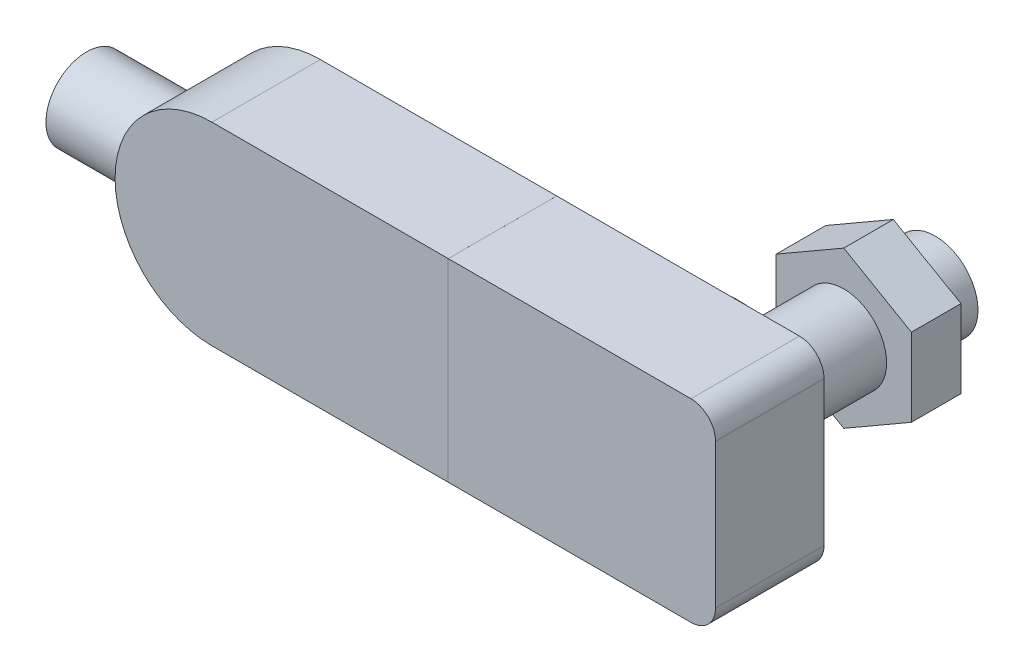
ISO-10303-21;
HEADER;
FILE_DESCRIPTION(('STEP AP214'),'2;1');
FILE_NAME('part.step','',(''),(''),'','','');
FILE_SCHEMA(('AUTOMOTIVE_DESIGN { 1 0 10303 214 1 1 1 1 }'));
ENDSEC;
DATA;
#1=APPLICATION_CONTEXT('core data for automotive mechanical design processes');
#2=APPLICATION_PROTOCOL_DEFINITION('international standard','automotive_design',2000,#1);
#3=PRODUCT_CONTEXT('',#1,'mechanical');
#4=PRODUCT('Part','Part','',(#3));
#5=PRODUCT_RELATED_PRODUCT_CATEGORY('part','',(#4));
#6=PRODUCT_DEFINITION_FORMATION('','',#4);
#7=PRODUCT_DEFINITION_CONTEXT('part definition',#1,'design');
#8=PRODUCT_DEFINITION('design','',#6,#7);
#9=PRODUCT_DEFINITION_SHAPE('','',#8);
#10=(LENGTH_UNIT() NAMED_UNIT(*) SI_UNIT(.MILLI.,.METRE.));
#11=(NAMED_UNIT(*) PLANE_ANGLE_UNIT() SI_UNIT($,.RADIAN.));
#12=(NAMED_UNIT(*) SI_UNIT($,.STERADIAN.) SOLID_ANGLE_UNIT());
#13=UNCERTAINTY_MEASURE_WITH_UNIT(LENGTH_MEASURE(1.E-05),#10,'distance_accuracy_value','');
#14=(GEOMETRIC_REPRESENTATION_CONTEXT(3) GLOBAL_UNCERTAINTY_ASSIGNED_CONTEXT((#13)) GLOBAL_UNIT_ASSIGNED_CONTEXT((#10,
#11,#12)) REPRESENTATION_CONTEXT('',''));
#15=CARTESIAN_POINT('',(0.,0.,0.));
#16=DIRECTION('',(0.,0.,1.));
#17=DIRECTION('',(1.,0.,0.));
#18=AXIS2_PLACEMENT_3D('',#15,#16,#17);
#19=CARTESIAN_POINT('',(-21.928,-12.5,65.2633204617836));
#20=DIRECTION('',(1.,0.,0.));
#21=DIRECTION('',(0.,0.,-1.));
#22=AXIS2_PLACEMENT_3D('',#19,#20,#21);
#23=PLANE('',#22);
#24=DIRECTION('',(0.,1.,0.));
#25=VECTOR('',#24,1.);
#26=CARTESIAN_POINT('',(-21.928,-12.5,15.524));
#27=LINE('',#26,#25);
#28=CARTESIAN_POINT('',(-21.928,-12.5,15.524));
#29=VERTEX_POINT('',#28);
#30=CARTESIAN_POINT('',(-21.928,12.5,15.524));
#31=VERTEX_POINT('',#30);
#32=EDGE_CURVE('E116',#29,#31,#27,.T.);
#33=ORIENTED_EDGE('',*,*,#32,.F.);
#34=DIRECTION('',(0.,0.,-1.));
#35=VECTOR('',#34,1.);
#36=CARTESIAN_POINT('',(-21.928,-12.5,65.2633204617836));
#37=LINE('',#36,#35);
#38=CARTESIAN_POINT('',(-21.928,-12.5,1.524));
#39=VERTEX_POINT('',#38);
#40=EDGE_CURVE('E110',#29,#39,#37,.T.);
#41=ORIENTED_EDGE('',*,*,#40,.T.);
#42=DIRECTION('',(0.,-1.,0.));
#43=VECTOR('',#42,1.);
#44=CARTESIAN_POINT('',(-21.928,-12.5,1.524));
#45=LINE('',#44,#43);
#46=CARTESIAN_POINT('',(-21.928,12.5,1.524));
#47=VERTEX_POINT('',#46);
#48=EDGE_CURVE('E114',#47,#39,#45,.T.);
#49=ORIENTED_EDGE('',*,*,#48,.F.);
#50=DIRECTION('',(0.,0.,-1.));
#51=VECTOR('',#50,1.);
#52=CARTESIAN_POINT('',(-21.928,12.5,65.2633204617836));
#53=LINE('',#52,#51);
#54=EDGE_CURVE('E141',#31,#47,#53,.T.);
#55=ORIENTED_EDGE('',*,*,#54,.F.);
#56=EDGE_LOOP('',(#33,#41,#49,#55));
#57=FACE_BOUND('',#56,.T.);
#58=ADVANCED_FACE('F71',(#57),#23,.T.);
#59=CARTESIAN_POINT('',(-21.928,12.5,65.2633204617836));
#60=DIRECTION('',(0.,1.,0.));
#61=DIRECTION('',(0.,0.,1.));
#62=AXIS2_PLACEMENT_3D('',#59,#60,#61);
#63=PLANE('',#62);
#64=DIRECTION('',(-1.,0.,0.));
#65=VECTOR('',#64,1.);
#66=CARTESIAN_POINT('',(-21.928,12.5,15.524));
#67=LINE('',#66,#65);
#68=CARTESIAN_POINT('',(-52.4280000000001,12.5,15.524));
#69=VERTEX_POINT('',#68);
#70=EDGE_CURVE('E146',#31,#69,#67,.T.);
#71=ORIENTED_EDGE('',*,*,#70,.F.);
#72=ORIENTED_EDGE('',*,*,#54,.T.);
#73=DIRECTION('',(1.,0.,0.));
#74=VECTOR('',#73,1.);
#75=CARTESIAN_POINT('',(-21.928,12.5,1.524));
#76=LINE('',#75,#74);
#77=CARTESIAN_POINT('',(-52.4280000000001,12.5,1.524));
#78=VERTEX_POINT('',#77);
#79=EDGE_CURVE('E119',#78,#47,#76,.T.);
#80=ORIENTED_EDGE('',*,*,#79,.F.);
#81=DIRECTION('',(0.,0.,-1.));
#82=VECTOR('',#81,1.);
#83=CARTESIAN_POINT('',(-52.4280000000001,12.5,65.2633204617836));
#84=LINE('',#83,#82);
#85=EDGE_CURVE('E144',#69,#78,#84,.T.);
#86=ORIENTED_EDGE('',*,*,#85,.F.);
#87=EDGE_LOOP('',(#71,#72,#80,#86));
#88=FACE_BOUND('',#87,.T.);
#89=ADVANCED_FACE('F155',(#88),#63,.T.);
#90=CARTESIAN_POINT('',(-52.4280000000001,0.,65.2633204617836));
#91=DIRECTION('',(0.,0.,-1.));
#92=DIRECTION('',(-1.,0.,0.));
#93=AXIS2_PLACEMENT_3D('',#90,#91,#92);
#94=CYLINDRICAL_SURFACE('',#93,12.5);
#95=CARTESIAN_POINT('',(-64.9280000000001,0.,13.75));
#96=CARTESIAN_POINT('',(-64.9279992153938,0.140572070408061,13.7499990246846));
#97=CARTESIAN_POINT('',(-64.925622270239,0.281190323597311,13.7443464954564));
#98=CARTESIAN_POINT('',(-64.9161737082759,0.561424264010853,13.7217894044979));
#99=CARTESIAN_POINT('',(-64.9090991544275,0.701039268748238,13.7048778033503));
#100=CARTESIAN_POINT('',(-64.890422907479,0.978456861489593,13.6599325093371));
#101=CARTESIAN_POINT('',(-64.878812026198,1.1162551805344,13.631876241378));
#102=CARTESIAN_POINT('',(-64.8513640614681,1.38881247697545,13.5649191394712));
#103=CARTESIAN_POINT('',(-64.8355252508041,1.52357018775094,13.526013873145));
#104=CARTESIAN_POINT('',(-64.8000960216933,1.78858468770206,13.4379025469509));
#105=CARTESIAN_POINT('',(-64.7805202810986,1.91885680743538,13.3887367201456));
#106=CARTESIAN_POINT('',(-64.7380659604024,2.17465512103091,13.2804493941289));
#107=CARTESIAN_POINT('',(-64.7151861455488,2.30017951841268,13.2213241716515));
#108=CARTESIAN_POINT('',(-64.6424318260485,2.66833358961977,13.0297747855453));
#109=CARTESIAN_POINT('',(-64.5883930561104,2.90289695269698,12.8830586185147));
#110=CARTESIAN_POINT('',(-64.4716191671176,3.35537124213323,12.5480894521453));
#111=CARTESIAN_POINT('',(-64.4085966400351,3.57200197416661,12.3582231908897));
#112=CARTESIAN_POINT('',(-64.2821402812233,3.97155924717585,11.9455213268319));
#113=CARTESIAN_POINT('',(-64.218706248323,4.15446777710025,11.7226682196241));
#114=CARTESIAN_POINT('',(-64.1267902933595,4.40417335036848,11.3615893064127));
#115=CARTESIAN_POINT('',(-64.096000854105,4.4848946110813,11.2333585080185));
#116=CARTESIAN_POINT('',(-64.0371204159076,4.63517257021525,10.9699456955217));
#117=CARTESIAN_POINT('',(-64.0090283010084,4.70473389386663,10.8347665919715));
#118=CARTESIAN_POINT('',(-63.9564712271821,4.8320911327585,10.5582925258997));
#119=CARTESIAN_POINT('',(-63.9320064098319,4.88988658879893,10.4169973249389));
#120=CARTESIAN_POINT('',(-63.8875843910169,4.99310372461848,10.1293391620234));
#121=CARTESIAN_POINT('',(-63.8676248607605,5.03853179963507,9.98297886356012));
#122=CARTESIAN_POINT('',(-63.8337921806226,5.11464131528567,9.69342363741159));
#123=CARTESIAN_POINT('',(-63.8196717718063,5.14592866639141,9.55041686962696));
#124=CARTESIAN_POINT('',(-63.7967022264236,5.19647799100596,9.26193644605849));
#125=CARTESIAN_POINT('',(-63.7878506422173,5.21574554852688,9.11646396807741));
#126=CARTESIAN_POINT('',(-63.7757448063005,5.2420318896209,8.82422251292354));
#127=CARTESIAN_POINT('',(-63.7724890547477,5.24905395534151,8.67745389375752));
#128=CARTESIAN_POINT('',(-63.7716963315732,5.25076718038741,8.38383328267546));
#129=CARTESIAN_POINT('',(-63.7741590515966,5.24545900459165,8.23698129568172));
#130=CARTESIAN_POINT('',(-63.7842916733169,5.22348235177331,7.95592606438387));
#131=CARTESIAN_POINT('',(-63.7915380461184,5.20773747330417,7.82163406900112));
#132=CARTESIAN_POINT('',(-63.8105720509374,5.1660022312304,7.5549360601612));
#133=CARTESIAN_POINT('',(-63.8223611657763,5.14000852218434,7.42253067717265));
#134=CARTESIAN_POINT('',(-63.8501127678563,5.07804007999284,7.16055336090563));
#135=CARTESIAN_POINT('',(-63.8660743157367,5.04206759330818,7.03098079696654));
#136=CARTESIAN_POINT('',(-63.901693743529,4.9604763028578,6.77541377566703));
#137=CARTESIAN_POINT('',(-63.9213530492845,4.91485377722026,6.64942072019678));
#138=CARTESIAN_POINT('',(-63.9859608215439,4.76193374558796,6.27270789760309));
#139=CARTESIAN_POINT('',(-64.0359337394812,4.63986677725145,6.02865882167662));
#140=CARTESIAN_POINT('',(-64.1437201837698,4.36053141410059,5.56367693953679));
#141=CARTESIAN_POINT('',(-64.2015368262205,4.20324901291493,5.34275338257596));
#142=CARTESIAN_POINT('',(-64.3245519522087,3.84206901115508,4.91014395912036));
#143=CARTESIAN_POINT('',(-64.3899576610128,3.6353257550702,4.70088650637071));
#144=CARTESIAN_POINT('',(-64.5166169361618,3.18888566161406,4.31912987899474));
#145=CARTESIAN_POINT('',(-64.5778694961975,2.9491808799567,4.14663959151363));
#146=CARTESIAN_POINT('',(-64.6624509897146,2.56631395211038,3.91748406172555));
#147=CARTESIAN_POINT('',(-64.6897107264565,2.43305405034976,3.84534729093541));
#148=CARTESIAN_POINT('',(-64.7406957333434,2.16026143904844,3.71264800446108));
#149=CARTESIAN_POINT('',(-64.7644224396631,2.02073130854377,3.65208078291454));
#150=CARTESIAN_POINT('',(-64.8076442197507,1.7364017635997,3.54312696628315));
#151=CARTESIAN_POINT('',(-64.8271402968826,1.59160360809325,3.49473748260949));
#152=CARTESIAN_POINT('',(-64.8613236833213,1.29781375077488,3.41064675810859));
#153=CARTESIAN_POINT('',(-64.8760113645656,1.14882237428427,3.37494453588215));
#154=CARTESIAN_POINT('',(-64.899351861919,0.857524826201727,3.31852031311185));
#155=CARTESIAN_POINT('',(-64.9083310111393,0.715401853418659,3.29698515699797));
#156=CARTESIAN_POINT('',(-64.9214323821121,0.429649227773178,3.26563691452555));
#157=CARTESIAN_POINT('',(-64.9255548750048,0.286019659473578,3.25582317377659));
#158=CARTESIAN_POINT('',(-64.928826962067,-0.00158068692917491,3.24803017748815));
#159=CARTESIAN_POINT('',(-64.9279777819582,-0.145551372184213,3.2500480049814));
#160=CARTESIAN_POINT('',(-64.921333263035,-0.432724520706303,3.26588804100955));
#161=CARTESIAN_POINT('',(-64.9155380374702,-0.575927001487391,3.27970997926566));
#162=CARTESIAN_POINT('',(-64.8995814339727,-0.853201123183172,3.31799960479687));
#163=CARTESIAN_POINT('',(-64.8896571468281,-0.987366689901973,3.34189000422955));
#164=CARTESIAN_POINT('',(-64.8657437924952,-1.25313166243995,3.39993437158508));
#165=CARTESIAN_POINT('',(-64.8517534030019,-1.38473021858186,3.43409167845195));
#166=CARTESIAN_POINT('',(-64.8200505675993,-1.64444018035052,3.51234543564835));
#167=CARTESIAN_POINT('',(-64.802339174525,-1.7725525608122,3.55643907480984));
#168=CARTESIAN_POINT('',(-64.7636143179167,-2.02457772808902,3.65418905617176));
#169=CARTESIAN_POINT('',(-64.7425995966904,-2.1484888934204,3.70784904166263));
#170=CARTESIAN_POINT('',(-64.673923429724,-2.52030675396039,3.88616165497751));
#171=CARTESIAN_POINT('',(-64.6216321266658,-2.76039478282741,4.02576569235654));
#172=CARTESIAN_POINT('',(-64.5098894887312,-3.21447345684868,4.33994512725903));
#173=CARTESIAN_POINT('',(-64.4504351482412,-3.42845307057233,4.51453522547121));
#174=CARTESIAN_POINT('',(-64.3254181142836,-3.84071763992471,4.90855548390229));
#175=CARTESIAN_POINT('',(-64.2597252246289,-4.03673716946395,5.13032004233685));
#176=CARTESIAN_POINT('',(-64.1334556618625,-4.38947882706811,5.60478698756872));
#177=CARTESIAN_POINT('',(-64.072880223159,-4.5461914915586,5.85749680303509));
#178=CARTESIAN_POINT('',(-63.9909051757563,-4.74917385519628,6.25707397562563));
#179=CARTESIAN_POINT('',(-63.964889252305,-4.81185757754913,6.39487841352));
#180=CARTESIAN_POINT('',(-63.916925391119,-4.92528060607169,6.67598172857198));
#181=CARTESIAN_POINT('',(-63.8949756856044,-4.97602510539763,6.81927818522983));
#182=CARTESIAN_POINT('',(-63.8559509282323,-5.06500747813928,7.11027157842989));
#183=CARTESIAN_POINT('',(-63.8388735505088,-5.10325132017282,7.25796637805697));
#184=CARTESIAN_POINT('',(-63.810238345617,-5.16680467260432,7.55663894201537));
#185=CARTESIAN_POINT('',(-63.7986799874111,-5.19211542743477,7.70761638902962));
#186=CARTESIAN_POINT('',(-63.7822171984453,-5.22801178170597,7.99967686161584));
#187=CARTESIAN_POINT('',(-63.7768641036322,-5.23959190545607,8.14061316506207));
#188=CARTESIAN_POINT('',(-63.7714337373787,-5.25133840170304,8.42305978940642));
#189=CARTESIAN_POINT('',(-63.7713561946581,-5.25150536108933,8.56457008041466));
#190=CARTESIAN_POINT('',(-63.7764795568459,-5.24042440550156,8.84702410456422));
#191=CARTESIAN_POINT('',(-63.7816796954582,-5.22917814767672,8.98796791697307));
#192=CARTESIAN_POINT('',(-63.7971718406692,-5.19540904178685,9.26820959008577));
#193=CARTESIAN_POINT('',(-63.807463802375,-5.17288629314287,9.40750746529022));
#194=CARTESIAN_POINT('',(-63.8321727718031,-5.11817327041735,9.67675254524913));
#195=CARTESIAN_POINT('',(-63.8463662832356,-5.08650305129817,9.80682622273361));
#196=CARTESIAN_POINT('',(-63.8786129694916,-5.01348645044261,10.0637507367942));
#197=CARTESIAN_POINT('',(-63.8966673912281,-4.97213694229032,10.1906005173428));
#198=CARTESIAN_POINT('',(-63.9558683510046,-4.83408099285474,10.5651488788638));
#199=CARTESIAN_POINT('',(-64.0020707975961,-4.72332887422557,10.8070324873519));
#200=CARTESIAN_POINT('',(-64.106181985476,-4.45996042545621,11.2838881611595));
#201=CARTESIAN_POINT('',(-64.1646308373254,-4.30521207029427,11.517550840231));
#202=CARTESIAN_POINT('',(-64.2852099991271,-3.96102495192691,11.9569626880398));
#203=CARTESIAN_POINT('',(-64.3473416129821,-3.77157385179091,12.1627018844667));
#204=CARTESIAN_POINT('',(-64.4410191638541,-3.45696382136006,12.4540406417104));
#205=CARTESIAN_POINT('',(-64.4734295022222,-3.34255794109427,12.551219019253));
#206=CARTESIAN_POINT('',(-64.536688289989,-3.10558859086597,12.7356022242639));
#207=CARTESIAN_POINT('',(-64.5675372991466,-2.983028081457,12.8228106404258));
#208=CARTESIAN_POINT('',(-64.6268553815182,-2.73034585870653,12.9866932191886));
#209=CARTESIAN_POINT('',(-64.6553222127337,-2.60021721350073,13.0633575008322));
#210=CARTESIAN_POINT('',(-64.709038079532,-2.33336929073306,13.2053923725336));
#211=CARTESIAN_POINT('',(-64.7342885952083,-2.19665308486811,13.2707681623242));
#212=CARTESIAN_POINT('',(-64.780500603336,-1.91967052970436,13.3887289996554));
#213=CARTESIAN_POINT('',(-64.8015225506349,-1.77949214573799,13.4414967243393));
#214=CARTESIAN_POINT('',(-64.8391488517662,-1.49465865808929,13.5349724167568));
#215=CARTESIAN_POINT('',(-64.8557553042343,-1.35000571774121,13.5756861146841));
#216=CARTESIAN_POINT('',(-64.8840382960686,-1.05765210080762,13.6445479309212));
#217=CARTESIAN_POINT('',(-64.8957269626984,-0.909959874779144,13.6727269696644));
#218=CARTESIAN_POINT('',(-64.9138747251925,-0.612460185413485,13.7163171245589));
#219=CARTESIAN_POINT('',(-64.9203376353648,-0.462654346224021,13.7317375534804));
#220=CARTESIAN_POINT('',(-64.9253950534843,-0.2604462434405,13.7437950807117));
#221=CARTESIAN_POINT('',(-64.9263713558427,-0.208391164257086,13.7461212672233));
#222=CARTESIAN_POINT('',(-64.9276739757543,-0.104226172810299,13.7492239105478));
#223=CARTESIAN_POINT('',(-64.9280002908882,-0.0521162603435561,13.7500003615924));
#224=CARTESIAN_POINT('',(-64.9280000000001,0.,13.75));
#225=B_SPLINE_CURVE_WITH_KNOTS('',3,(#95,#96,#97,#98,#99,#100,#101,#102,#103,#104,#105,#106,
#107,#108,#109,#110,#111,#112,#113,#114,#115,#116,#117,#118,#119,#120,#121,#122,#123,#124,#125,
#126,#127,#128,#129,#130,#131,#132,#133,#134,#135,#136,#137,#138,#139,#140,#141,#142,#143,#144,
#145,#146,#147,#148,#149,#150,#151,#152,#153,#154,#155,#156,#157,#158,#159,#160,#161,#162,#163,
#164,#165,#166,#167,#168,#169,#170,#171,#172,#173,#174,#175,#176,#177,#178,#179,#180,#181,#182,
#183,#184,#185,#186,#187,#188,#189,#190,#191,#192,#193,#194,#195,#196,#197,#198,#199,#200,#201,
#202,#203,#204,#205,#206,#207,#208,#209,#210,#211,#212,#213,#214,#215,#216,#217,#218,#219,#220,
#221,#222,#223,#224),.UNSPECIFIED.,.T.,.F.,(4,2,2,2,2,2,2,2,2,2,2,2,2,2,2,2,2,2,2,2,2,2,2,2,2,2,
2,2,2,2,2,2,2,2,2,2,2,2,2,2,2,2,2,2,2,2,2,2,2,2,2,2,2,2,2,2,2,2,2,2,2,2,2,2,4),(0.,
0.421663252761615,0.843590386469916,1.26637658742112,1.68933577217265,2.11066663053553,
2.53215535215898,3.37401983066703,4.25500192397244,5.13645319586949,5.59982801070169,
6.06301028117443,6.52621062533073,6.98917098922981,7.42978704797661,7.87019825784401,
8.31049140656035,8.75076081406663,9.15650140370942,9.56237454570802,9.96815639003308,
10.374095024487,11.2025417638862,12.0313185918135,12.9313706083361,13.8316399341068,
14.2930316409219,14.7542352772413,15.2153294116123,15.6763878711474,16.1079094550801,
16.5394069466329,16.9707980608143,17.4021792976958,17.8116172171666,18.2211884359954,
18.6306439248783,19.0402556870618,19.8841366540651,20.7283729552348,21.6338675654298,
22.5395799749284,22.9999010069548,23.4600214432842,23.9199218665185,24.3797780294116,
24.8037674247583,25.2277350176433,25.6516410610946,26.0755433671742,26.4789507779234,
26.8824886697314,27.6889986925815,28.5444335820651,29.4001731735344,29.8604156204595,
30.3204918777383,30.7809963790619,31.2412881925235,31.69444004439,32.1473761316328,
32.5991886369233,33.0506710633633,33.2069996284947,33.3633287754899),.UNSPECIFIED.);
#226=CARTESIAN_POINT('',(-64.9280000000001,0.,13.75));
#227=VERTEX_POINT('',#226);
#228=EDGE_CURVE('E14',#227,#227,#225,.T.);
#229=ORIENTED_EDGE('',*,*,#228,.F.);
#230=EDGE_LOOP('',(#229));
#231=FACE_BOUND('',#230,.T.);
#232=CARTESIAN_POINT('',(-52.4280000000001,0.,15.524));
#233=DIRECTION('',(0.,0.,-1.));
#234=DIRECTION('',(-1.,0.,0.));
#235=AXIS2_PLACEMENT_3D('',#232,#233,#234);
#236=CIRCLE('',#235,12.5);
#237=CARTESIAN_POINT('',(-52.4280000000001,-12.5,15.524));
#238=VERTEX_POINT('',#237);
#239=EDGE_CURVE('E143',#69,#238,#236,.F.);
#240=ORIENTED_EDGE('',*,*,#239,.F.);
#241=ORIENTED_EDGE('',*,*,#85,.T.);
#242=CARTESIAN_POINT('',(-52.4280000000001,0.,1.524));
#243=DIRECTION('',(0.,0.,-1.));
#244=DIRECTION('',(1.,0.,0.));
#245=AXIS2_PLACEMENT_3D('',#242,#243,#244);
#246=CIRCLE('',#245,12.5);
#247=CARTESIAN_POINT('',(-52.4280000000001,-12.5,1.524));
#248=VERTEX_POINT('',#247);
#249=EDGE_CURVE('E128',#248,#78,#246,.T.);
#250=ORIENTED_EDGE('',*,*,#249,.F.);
#251=DIRECTION('',(0.,0.,-1.));
#252=VECTOR('',#251,1.);
#253=CARTESIAN_POINT('',(-52.4280000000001,-12.5,65.2633204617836));
#254=LINE('',#253,#252);
#255=EDGE_CURVE('E118',#238,#248,#254,.T.);
#256=ORIENTED_EDGE('',*,*,#255,.F.);
#257=EDGE_LOOP('',(#240,#241,#250,#256));
#258=FACE_BOUND('',#257,.T.);
#259=ADVANCED_FACE('F153',(#231,#258),#94,.T.);
#260=CARTESIAN_POINT('',(-21.928,-12.5,65.2633204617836));
#261=DIRECTION('',(0.,-1.,0.));
#262=DIRECTION('',(0.,0.,-1.));
#263=AXIS2_PLACEMENT_3D('',#260,#261,#262);
#264=PLANE('',#263);
#265=DIRECTION('',(1.,0.,0.));
#266=VECTOR('',#265,1.);
#267=CARTESIAN_POINT('',(-21.928,-12.5,15.524));
#268=LINE('',#267,#266);
#269=EDGE_CURVE('E83',#238,#29,#268,.T.);
#270=ORIENTED_EDGE('',*,*,#269,.F.);
#271=ORIENTED_EDGE('',*,*,#255,.T.);
#272=DIRECTION('',(-1.,0.,0.));
#273=VECTOR('',#272,1.);
#274=CARTESIAN_POINT('',(-21.928,-12.5,1.524));
#275=LINE('',#274,#273);
#276=EDGE_CURVE('E122',#39,#248,#275,.T.);
#277=ORIENTED_EDGE('',*,*,#276,.F.);
#278=ORIENTED_EDGE('',*,*,#40,.F.);
#279=EDGE_LOOP('',(#270,#271,#277,#278));
#280=FACE_BOUND('',#279,.T.);
#281=ADVANCED_FACE('F123',(#280),#264,.T.);
#282=CARTESIAN_POINT('',(-52.4280000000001,0.,1.524));
#283=DIRECTION('',(0.,0.,1.));
#284=DIRECTION('',(1.,0.,0.));
#285=AXIS2_PLACEMENT_3D('',#282,#283,#284);
#286=PLANE('',#285);
#287=ORIENTED_EDGE('',*,*,#48,.T.);
#288=ORIENTED_EDGE('',*,*,#276,.T.);
#289=ORIENTED_EDGE('',*,*,#249,.T.);
#290=ORIENTED_EDGE('',*,*,#79,.T.);
#291=EDGE_LOOP('',(#287,#288,#289,#290));
#292=FACE_BOUND('',#291,.T.);
#293=ADVANCED_FACE('F130',(#292),#286,.F.);
#294=CARTESIAN_POINT('',(-21.927,12.5,15.524));
#295=DIRECTION('',(0.,0.,-1.));
#296=DIRECTION('',(-1.,0.,0.));
#297=AXIS2_PLACEMENT_3D('',#294,#295,#296);
#298=PLANE('',#297);
#299=ORIENTED_EDGE('',*,*,#32,.T.);
#300=ORIENTED_EDGE('',*,*,#70,.T.);
#301=ORIENTED_EDGE('',*,*,#239,.T.);
#302=ORIENTED_EDGE('',*,*,#269,.T.);
#303=EDGE_LOOP('',(#299,#300,#301,#302));
#304=FACE_BOUND('',#303,.T.);
#305=ADVANCED_FACE('F150',(#304),#298,.F.);
#306=CARTESIAN_POINT('',(-75.6280000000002,0.,8.50000000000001));
#307=DIRECTION('',(1.,0.,0.));
#308=DIRECTION('',(0.,0.,-1.));
#309=AXIS2_PLACEMENT_3D('',#306,#307,#308);
#310=CYLINDRICAL_SURFACE('',#309,5.25);
#311=ORIENTED_EDGE('',*,*,#228,.T.);
#312=EDGE_LOOP('',(#311));
#313=FACE_BOUND('',#312,.T.);
#314=CARTESIAN_POINT('',(-75.6280000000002,0.,8.50000000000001));
#315=DIRECTION('',(1.,0.,0.));
#316=DIRECTION('',(0.,0.,-1.));
#317=AXIS2_PLACEMENT_3D('',#314,#315,#316);
#318=CIRCLE('',#317,5.25);
#319=CARTESIAN_POINT('',(-75.6280000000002,0.,3.25000000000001));
#320=VERTEX_POINT('',#319);
#321=EDGE_CURVE('E132',#320,#320,#318,.T.);
#322=ORIENTED_EDGE('',*,*,#321,.T.);
#323=EDGE_LOOP('',(#322));
#324=FACE_BOUND('',#323,.T.);
#325=ADVANCED_FACE('F173',(#313,#324),#310,.T.);
#326=CARTESIAN_POINT('',(-75.6280000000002,0.,8.50000000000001));
#327=DIRECTION('',(1.,0.,0.));
#328=DIRECTION('',(0.,0.,-1.));
#329=AXIS2_PLACEMENT_3D('',#326,#327,#328);
#330=PLANE('',#329);
#331=ORIENTED_EDGE('',*,*,#321,.F.);
#332=EDGE_LOOP('',(#331));
#333=FACE_BOUND('',#332,.T.);
#334=ADVANCED_FACE('F177',(#333),#330,.F.);
#335=CLOSED_SHELL('',(#58,#89,#259,#281,#293,#305,#325,#334));
#336=MANIFOLD_SOLID_BREP('B2',#335);
#337=CARTESIAN_POINT('',(0.,0.,-25.4));
#338=DIRECTION('',(0.,0.,1.));
#339=DIRECTION('',(1.,0.,0.));
#340=AXIS2_PLACEMENT_3D('',#337,#338,#339);
#341=CYLINDRICAL_SURFACE('',#340,5.5245);
#342=CARTESIAN_POINT('',(0.,0.,0.));
#343=DIRECTION('',(0.,0.,1.));
#344=DIRECTION('',(1.,0.,0.));
#345=AXIS2_PLACEMENT_3D('',#342,#343,#344);
#346=CIRCLE('',#345,5.5245);
#347=CARTESIAN_POINT('',(5.52450000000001,0.,0.));
#348=VERTEX_POINT('',#347);
#349=EDGE_CURVE('E419',#348,#348,#346,.T.);
#350=ORIENTED_EDGE('',*,*,#349,.F.);
#351=EDGE_LOOP('',(#350));
#352=FACE_BOUND('',#351,.T.);
#353=CARTESIAN_POINT('',(0.,0.,-13.6));
#354=DIRECTION('',(0.,0.,-1.));
#355=DIRECTION('',(-1.,0.,0.));
#356=AXIS2_PLACEMENT_3D('',#353,#354,#355);
#357=CIRCLE('',#356,5.5245);
#358=CARTESIAN_POINT('',(-5.52450000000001,0.,-13.6));
#359=VERTEX_POINT('',#358);
#360=EDGE_CURVE('E219',#359,#359,#357,.F.);
#361=ORIENTED_EDGE('',*,*,#360,.T.);
#362=EDGE_LOOP('',(#361));
#363=FACE_BOUND('',#362,.T.);
#364=ADVANCED_FACE('F215',(#352,#363),#341,.T.);
#365=CARTESIAN_POINT('',(0.,0.,1.524));
#366=DIRECTION('',(0.,0.,-1.));
#367=DIRECTION('',(-1.,0.,0.));
#368=AXIS2_PLACEMENT_3D('',#365,#366,#367);
#369=CYLINDRICAL_SURFACE('',#368,11.049);
#370=CARTESIAN_POINT('',(0.,0.,1.524));
#371=DIRECTION('',(0.,0.,1.));
#372=DIRECTION('',(1.,0.,0.));
#373=AXIS2_PLACEMENT_3D('',#370,#371,#372);
#374=CIRCLE('',#373,11.049);
#375=CARTESIAN_POINT('',(-11.049,0.,1.524));
#376=VERTEX_POINT('',#375);
#377=EDGE_CURVE('E415',#376,#376,#374,.T.);
#378=CARTESIAN_POINT('',(0.,0.,0.));
#379=DIRECTION('',(0.,0.,1.));
#380=DIRECTION('',(1.,0.,0.));
#381=AXIS2_PLACEMENT_3D('',#378,#379,#380);
#382=CIRCLE('',#381,11.049);
#383=CARTESIAN_POINT('',(-11.049,0.,0.));
#384=VERTEX_POINT('',#383);
#385=EDGE_CURVE('E412',#384,#384,#382,.T.);
#386=CARTESIAN_POINT('',(-11.049,0.,1.524));
#387=CARTESIAN_POINT('',(-11.049,0.,1.508125));
#388=CARTESIAN_POINT('',(-11.049,0.,1.49225));
#389=CARTESIAN_POINT('',(-11.049,0.,1.4605));
#390=CARTESIAN_POINT('',(-11.049,0.,1.444625));
#391=CARTESIAN_POINT('',(-11.049,0.,1.412875));
#392=CARTESIAN_POINT('',(-11.049,0.,1.397));
#393=CARTESIAN_POINT('',(-11.049,0.,1.36525));
#394=CARTESIAN_POINT('',(-11.049,0.,1.349375));
#395=CARTESIAN_POINT('',(-11.049,0.,1.317625));
#396=CARTESIAN_POINT('',(-11.049,0.,1.30175));
#397=CARTESIAN_POINT('',(-11.049,0.,1.27));
#398=CARTESIAN_POINT('',(-11.049,0.,1.254125));
#399=CARTESIAN_POINT('',(-11.049,0.,1.222375));
#400=CARTESIAN_POINT('',(-11.049,0.,1.2065));
#401=CARTESIAN_POINT('',(-11.049,0.,1.17475));
#402=CARTESIAN_POINT('',(-11.049,0.,1.158875));
#403=CARTESIAN_POINT('',(-11.049,0.,1.127125));
#404=CARTESIAN_POINT('',(-11.049,0.,1.11125));
#405=CARTESIAN_POINT('',(-11.049,0.,1.0795));
#406=CARTESIAN_POINT('',(-11.049,0.,1.063625));
#407=CARTESIAN_POINT('',(-11.049,0.,1.031875));
#408=CARTESIAN_POINT('',(-11.049,0.,1.016));
#409=CARTESIAN_POINT('',(-11.049,0.,0.984249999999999));
#410=CARTESIAN_POINT('',(-11.049,0.,0.968374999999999));
#411=CARTESIAN_POINT('',(-11.049,0.,0.936624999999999));
#412=CARTESIAN_POINT('',(-11.049,0.,0.920749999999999));
#413=CARTESIAN_POINT('',(-11.049,0.,0.888999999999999));
#414=CARTESIAN_POINT('',(-11.049,0.,0.873124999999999));
#415=CARTESIAN_POINT('',(-11.049,0.,0.841374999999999));
#416=CARTESIAN_POINT('',(-11.049,0.,0.825499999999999));
#417=CARTESIAN_POINT('',(-11.049,0.,0.793749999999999));
#418=CARTESIAN_POINT('',(-11.049,0.,0.777874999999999));
#419=CARTESIAN_POINT('',(-11.049,0.,0.746124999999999));
#420=CARTESIAN_POINT('',(-11.049,0.,0.730249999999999));
#421=CARTESIAN_POINT('',(-11.049,0.,0.698499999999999));
#422=CARTESIAN_POINT('',(-11.049,0.,0.682624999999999));
#423=CARTESIAN_POINT('',(-11.049,0.,0.650874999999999));
#424=CARTESIAN_POINT('',(-11.049,0.,0.634999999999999));
#425=CARTESIAN_POINT('',(-11.049,0.,0.603249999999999));
#426=CARTESIAN_POINT('',(-11.049,0.,0.587374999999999));
#427=CARTESIAN_POINT('',(-11.049,0.,0.555624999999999));
#428=CARTESIAN_POINT('',(-11.049,0.,0.539749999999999));
#429=CARTESIAN_POINT('',(-11.049,0.,0.507999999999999));
#430=CARTESIAN_POINT('',(-11.049,0.,0.492124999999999));
#431=CARTESIAN_POINT('',(-11.049,0.,0.460374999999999));
#432=CARTESIAN_POINT('',(-11.049,0.,0.4445));
#433=CARTESIAN_POINT('',(-11.049,0.,0.41275));
#434=CARTESIAN_POINT('',(-11.049,0.,0.396875));
#435=CARTESIAN_POINT('',(-11.049,0.,0.365125));
#436=CARTESIAN_POINT('',(-11.049,0.,0.34925));
#437=CARTESIAN_POINT('',(-11.049,0.,0.3175));
#438=CARTESIAN_POINT('',(-11.049,0.,0.301625));
#439=CARTESIAN_POINT('',(-11.049,0.,0.269875));
#440=CARTESIAN_POINT('',(-11.049,0.,0.254));
#441=CARTESIAN_POINT('',(-11.049,0.,0.22225));
#442=CARTESIAN_POINT('',(-11.049,0.,0.206375));
#443=CARTESIAN_POINT('',(-11.049,0.,0.174625));
#444=CARTESIAN_POINT('',(-11.049,0.,0.15875));
#445=CARTESIAN_POINT('',(-11.049,0.,0.127));
#446=CARTESIAN_POINT('',(-11.049,0.,0.111125));
#447=CARTESIAN_POINT('',(-11.049,0.,0.0793750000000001));
#448=CARTESIAN_POINT('',(-11.049,0.,0.0635000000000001));
#449=CARTESIAN_POINT('',(-11.049,0.,0.0317500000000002));
#450=CARTESIAN_POINT('',(-11.049,0.,0.0158750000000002));
#451=CARTESIAN_POINT('',(-11.049,0.,0.));
#452=B_SPLINE_CURVE_WITH_KNOTS('',3,(#386,#387,#388,#389,#390,#391,#392,#393,#394,#395,#396,
#397,#398,#399,#400,#401,#402,#403,#404,#405,#406,#407,#408,#409,#410,#411,#412,#413,#414,#415,
#416,#417,#418,#419,#420,#421,#422,#423,#424,#425,#426,#427,#428,#429,#430,#431,#432,#433,#434,
#435,#436,#437,#438,#439,#440,#441,#442,#443,#444,#445,#446,#447,#448,#449,#450,#451),
.UNSPECIFIED.,.F.,.F.,(4,2,2,2,2,2,2,2,2,2,2,2,2,2,2,2,2,2,2,2,2,2,2,2,2,2,2,2,2,2,2,2,4),(0.,
0.0476250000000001,0.0952500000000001,0.142875,0.1905,0.238125,0.28575,0.333375,0.381,0.428625,
0.476249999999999,0.523874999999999,0.571499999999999,0.619124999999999,0.666749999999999,
0.714374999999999,0.761999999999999,0.809624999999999,0.857249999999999,0.904874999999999,
0.952499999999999,1.000125,1.04775,1.095375,1.143,1.190625,1.23825,1.285875,1.3335,1.381125,
1.42875,1.476375,1.524),.UNSPECIFIED.);
#453=EDGE_CURVE('BSEAM481',#376,#384,#452,.T.);
#454=ORIENTED_EDGE('',*,*,#377,.F.);
#455=ORIENTED_EDGE('',*,*,#385,.T.);
#456=ORIENTED_EDGE('',*,*,#453,.T.);
#457=ORIENTED_EDGE('',*,*,#453,.F.);
#458=EDGE_LOOP('',(#454,#456,#455,#457));
#459=FACE_BOUND('',#458,.T.);
#460=ADVANCED_FACE('F481',(#459),#369,.T.);
#461=CARTESIAN_POINT('',(0.,0.,0.));
#462=DIRECTION('',(0.,0.,1.));
#463=DIRECTION('',(1.,0.,0.));
#464=AXIS2_PLACEMENT_3D('',#461,#462,#463);
#465=PLANE('',#464);
#466=CARTESIAN_POINT('',(0.,0.,0.));
#467=DIRECTION('',(0.,0.,-1.));
#468=DIRECTION('',(-1.,0.,0.));
#469=AXIS2_PLACEMENT_3D('',#466,#467,#468);
#470=CIRCLE('',#469,8.509);
#471=CARTESIAN_POINT('',(-8.50900000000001,0.,0.));
#472=VERTEX_POINT('',#471);
#473=EDGE_CURVE('E406',#472,#472,#470,.T.);
#474=ORIENTED_EDGE('',*,*,#473,.F.);
#475=EDGE_LOOP('',(#474));
#476=FACE_BOUND('',#475,.T.);
#477=ORIENTED_EDGE('',*,*,#385,.F.);
#478=EDGE_LOOP('',(#477));
#479=FACE_BOUND('',#478,.T.);
#480=ADVANCED_FACE('F488',(#476,#479),#465,.F.);
#481=CARTESIAN_POINT('',(0.,0.,1.32080000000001));
#482=DIRECTION('',(0.,0.,-1.));
#483=DIRECTION('',(-1.,0.,0.));
#484=AXIS2_PLACEMENT_3D('',#481,#482,#483);
#485=CYLINDRICAL_SURFACE('',#484,8.509);
#486=CARTESIAN_POINT('',(0.,0.,1.32080000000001));
#487=DIRECTION('',(0.,0.,-1.));
#488=DIRECTION('',(-1.,0.,0.));
#489=AXIS2_PLACEMENT_3D('',#486,#487,#488);
#490=CIRCLE('',#489,8.509);
#491=CARTESIAN_POINT('',(-8.50900000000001,0.,1.32080000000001));
#492=VERTEX_POINT('',#491);
#493=EDGE_CURVE('E409',#492,#492,#490,.T.);
#494=ORIENTED_EDGE('',*,*,#493,.F.);
#495=EDGE_LOOP('',(#494));
#496=FACE_BOUND('',#495,.T.);
#497=ORIENTED_EDGE('',*,*,#473,.T.);
#498=EDGE_LOOP('',(#497));
#499=FACE_BOUND('',#498,.T.);
#500=ADVANCED_FACE('F648',(#496,#499),#485,.F.);
#501=CARTESIAN_POINT('',(0.,0.,1.32080000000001));
#502=DIRECTION('',(0.,0.,-1.));
#503=DIRECTION('',(-1.,0.,0.));
#504=AXIS2_PLACEMENT_3D('',#501,#502,#503);
#505=PLANE('',#504);
#506=CARTESIAN_POINT('',(0.,0.,1.32080000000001));
#507=DIRECTION('',(0.,0.,-1.));
#508=DIRECTION('',(-1.,0.,0.));
#509=AXIS2_PLACEMENT_3D('',#506,#507,#508);
#510=CIRCLE('',#509,6.35);
#511=CARTESIAN_POINT('',(-6.35000000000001,0.,1.32080000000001));
#512=VERTEX_POINT('',#511);
#513=EDGE_CURVE('E403',#512,#512,#510,.T.);
#514=ORIENTED_EDGE('',*,*,#513,.F.);
#515=EDGE_LOOP('',(#514));
#516=FACE_BOUND('',#515,.T.);
#517=ORIENTED_EDGE('',*,*,#493,.T.);
#518=EDGE_LOOP('',(#517));
#519=FACE_BOUND('',#518,.T.);
#520=ADVANCED_FACE('F659',(#516,#519),#505,.T.);
#521=CARTESIAN_POINT('',(0.,0.,1.32080000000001));
#522=DIRECTION('',(0.,0.,-1.));
#523=DIRECTION('',(-1.,0.,0.));
#524=AXIS2_PLACEMENT_3D('',#521,#522,#523);
#525=CYLINDRICAL_SURFACE('',#524,6.35);
#526=ORIENTED_EDGE('',*,*,#513,.T.);
#527=EDGE_LOOP('',(#526));
#528=FACE_BOUND('',#527,.T.);
#529=CARTESIAN_POINT('',(0.,0.,0.));
#530=DIRECTION('',(0.,0.,-1.));
#531=DIRECTION('',(-1.,0.,0.));
#532=AXIS2_PLACEMENT_3D('',#529,#530,#531);
#533=CIRCLE('',#532,6.35);
#534=CARTESIAN_POINT('',(-6.35000000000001,0.,0.));
#535=VERTEX_POINT('',#534);
#536=EDGE_CURVE('E402',#535,#535,#533,.T.);
#537=ORIENTED_EDGE('',*,*,#536,.F.);
#538=EDGE_LOOP('',(#537));
#539=FACE_BOUND('',#538,.T.);
#540=ADVANCED_FACE('F669',(#528,#539),#525,.T.);
#541=ORIENTED_EDGE('',*,*,#349,.T.);
#542=EDGE_LOOP('',(#541));
#543=FACE_BOUND('',#542,.T.);
#544=ORIENTED_EDGE('',*,*,#536,.T.);
#545=EDGE_LOOP('',(#544));
#546=FACE_BOUND('',#545,.T.);
#547=ADVANCED_FACE('F477',(#543,#546),#465,.F.);
#548=CARTESIAN_POINT('',(-21.927,12.5,1.524));
#549=DIRECTION('',(0.,0.,1.));
#550=DIRECTION('',(1.,0.,0.));
#551=AXIS2_PLACEMENT_3D('',#548,#549,#550);
#552=PLANE('',#551);
#553=DIRECTION('',(-1.,0.,0.));
#554=VECTOR('',#553,1.);
#555=CARTESIAN_POINT('',(-21.927,12.5,1.524));
#556=LINE('',#555,#554);
#557=CARTESIAN_POINT('',(9.39800000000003,12.5,1.524));
#558=VERTEX_POINT('',#557);
#559=CARTESIAN_POINT('',(-21.927,12.5,1.524));
#560=VERTEX_POINT('',#559);
#561=EDGE_CURVE('E381',#558,#560,#556,.T.);
#562=ORIENTED_EDGE('',*,*,#561,.F.);
#563=CARTESIAN_POINT('',(9.39800000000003,9.32500000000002,1.524));
#564=DIRECTION('',(0.,0.,1.));
#565=DIRECTION('',(1.,0.,0.));
#566=AXIS2_PLACEMENT_3D('',#563,#564,#565);
#567=CIRCLE('',#566,3.175);
#568=CARTESIAN_POINT('',(12.573,9.32500000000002,1.524));
#569=VERTEX_POINT('',#568);
#570=EDGE_CURVE('E434',#558,#569,#567,.F.);
#571=ORIENTED_EDGE('',*,*,#570,.T.);
#572=DIRECTION('',(0.,-1.,0.));
#573=VECTOR('',#572,1.);
#574=CARTESIAN_POINT('',(12.573,12.5,1.524));
#575=LINE('',#574,#573);
#576=CARTESIAN_POINT('',(12.573,-9.32499999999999,1.524));
#577=VERTEX_POINT('',#576);
#578=EDGE_CURVE('E393',#569,#577,#575,.T.);
#579=ORIENTED_EDGE('',*,*,#578,.T.);
#580=CARTESIAN_POINT('',(9.39800000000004,-9.32499999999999,1.524));
#581=DIRECTION('',(0.,0.,1.));
#582=DIRECTION('',(1.,0.,0.));
#583=AXIS2_PLACEMENT_3D('',#580,#581,#582);
#584=CIRCLE('',#583,3.175);
#585=CARTESIAN_POINT('',(9.39800000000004,-12.5,1.524));
#586=VERTEX_POINT('',#585);
#587=EDGE_CURVE('E432',#577,#586,#584,.F.);
#588=ORIENTED_EDGE('',*,*,#587,.T.);
#589=DIRECTION('',(-1.,0.,0.));
#590=VECTOR('',#589,1.);
#591=CARTESIAN_POINT('',(-21.927,-12.5,1.524));
#592=LINE('',#591,#590);
#593=CARTESIAN_POINT('',(-21.927,-12.5,1.524));
#594=VERTEX_POINT('',#593);
#595=EDGE_CURVE('E378',#586,#594,#592,.T.);
#596=ORIENTED_EDGE('',*,*,#595,.T.);
#597=DIRECTION('',(0.,-1.,0.));
#598=VECTOR('',#597,1.);
#599=CARTESIAN_POINT('',(-21.927,12.5,1.524));
#600=LINE('',#599,#598);
#601=EDGE_CURVE('E384',#560,#594,#600,.T.);
#602=ORIENTED_EDGE('',*,*,#601,.F.);
#603=EDGE_LOOP('',(#562,#571,#579,#588,#596,#602));
#604=FACE_BOUND('',#603,.T.);
#605=ORIENTED_EDGE('',*,*,#377,.T.);
#606=EDGE_LOOP('',(#605));
#607=FACE_BOUND('',#606,.T.);
#608=ADVANCED_FACE('F459',(#604,#607),#552,.F.);
#609=CARTESIAN_POINT('',(-21.927,12.5,1.524));
#610=DIRECTION('',(1.,0.,0.));
#611=DIRECTION('',(0.,0.,-1.));
#612=AXIS2_PLACEMENT_3D('',#609,#610,#611);
#613=PLANE('',#612);
#614=DIRECTION('',(0.,0.,1.));
#615=VECTOR('',#614,1.);
#616=CARTESIAN_POINT('',(-21.927,-12.5,1.524));
#617=LINE('',#616,#615);
#618=CARTESIAN_POINT('',(-21.927,-12.5,15.524));
#619=VERTEX_POINT('',#618);
#620=EDGE_CURVE('E385',#594,#619,#617,.T.);
#621=ORIENTED_EDGE('',*,*,#620,.T.);
#622=DIRECTION('',(0.,-1.,0.));
#623=VECTOR('',#622,1.);
#624=CARTESIAN_POINT('',(-21.927,12.5,15.524));
#625=LINE('',#624,#623);
#626=CARTESIAN_POINT('',(-21.927,12.5,15.524));
#627=VERTEX_POINT('',#626);
#628=EDGE_CURVE('E399',#627,#619,#625,.T.);
#629=ORIENTED_EDGE('',*,*,#628,.F.);
#630=DIRECTION('',(0.,0.,1.));
#631=VECTOR('',#630,1.);
#632=CARTESIAN_POINT('',(-21.927,12.5,1.524));
#633=LINE('',#632,#631);
#634=EDGE_CURVE('E374',#560,#627,#633,.T.);
#635=ORIENTED_EDGE('',*,*,#634,.F.);
#636=ORIENTED_EDGE('',*,*,#601,.T.);
#637=EDGE_LOOP('',(#621,#629,#635,#636));
#638=FACE_BOUND('',#637,.T.);
#639=ADVANCED_FACE('F469',(#638),#613,.F.);
#640=CARTESIAN_POINT('',(-21.927,12.5,15.524));
#641=DIRECTION('',(0.,0.,-1.));
#642=DIRECTION('',(-1.,0.,0.));
#643=AXIS2_PLACEMENT_3D('',#640,#641,#642);
#644=PLANE('',#643);
#645=DIRECTION('',(0.,-1.,0.));
#646=VECTOR('',#645,1.);
#647=CARTESIAN_POINT('',(12.573,12.5,15.524));
#648=LINE('',#647,#646);
#649=CARTESIAN_POINT('',(12.573,9.32500000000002,15.524));
#650=VERTEX_POINT('',#649);
#651=CARTESIAN_POINT('',(12.5730000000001,-9.325,15.524));
#652=VERTEX_POINT('',#651);
#653=EDGE_CURVE('E397',#650,#652,#648,.T.);
#654=ORIENTED_EDGE('',*,*,#653,.F.);
#655=CARTESIAN_POINT('',(9.39800000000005,9.32500000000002,15.524));
#656=DIRECTION('',(0.,0.,-1.));
#657=DIRECTION('',(-1.,0.,0.));
#658=AXIS2_PLACEMENT_3D('',#655,#656,#657);
#659=CIRCLE('',#658,3.175);
#660=CARTESIAN_POINT('',(9.39800000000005,12.5,15.524));
#661=VERTEX_POINT('',#660);
#662=EDGE_CURVE('E444',#650,#661,#659,.F.);
#663=ORIENTED_EDGE('',*,*,#662,.T.);
#664=DIRECTION('',(1.,0.,0.));
#665=VECTOR('',#664,1.);
#666=CARTESIAN_POINT('',(-21.927,12.5,15.524));
#667=LINE('',#666,#665);
#668=EDGE_CURVE('E377',#627,#661,#667,.T.);
#669=ORIENTED_EDGE('',*,*,#668,.F.);
#670=ORIENTED_EDGE('',*,*,#628,.T.);
#671=DIRECTION('',(1.,0.,0.));
#672=VECTOR('',#671,1.);
#673=CARTESIAN_POINT('',(-21.927,-12.5,15.524));
#674=LINE('',#673,#672);
#675=CARTESIAN_POINT('',(9.39800000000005,-12.5,15.524));
#676=VERTEX_POINT('',#675);
#677=EDGE_CURVE('E388',#619,#676,#674,.T.);
#678=ORIENTED_EDGE('',*,*,#677,.T.);
#679=CARTESIAN_POINT('',(9.39800000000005,-9.325,15.524));
#680=DIRECTION('',(0.,0.,-1.));
#681=DIRECTION('',(-1.,0.,0.));
#682=AXIS2_PLACEMENT_3D('',#679,#680,#681);
#683=CIRCLE('',#682,3.175);
#684=EDGE_CURVE('E237',#676,#652,#683,.F.);
#685=ORIENTED_EDGE('',*,*,#684,.T.);
#686=EDGE_LOOP('',(#654,#663,#669,#670,#678,#685));
#687=FACE_BOUND('',#686,.T.);
#688=ADVANCED_FACE('F447',(#687),#644,.F.);
#689=CARTESIAN_POINT('',(12.573,12.5,1.524));
#690=DIRECTION('',(-1.,0.,0.));
#691=DIRECTION('',(0.,0.,1.));
#692=AXIS2_PLACEMENT_3D('',#689,#690,#691);
#693=PLANE('',#692);
#694=ORIENTED_EDGE('',*,*,#578,.F.);
#695=DIRECTION('',(0.,0.,-1.));
#696=VECTOR('',#695,1.);
#697=CARTESIAN_POINT('',(12.573,9.32500000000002,15.524));
#698=LINE('',#697,#696);
#699=EDGE_CURVE('E440',#569,#650,#698,.F.);
#700=ORIENTED_EDGE('',*,*,#699,.T.);
#701=ORIENTED_EDGE('',*,*,#653,.T.);
#702=DIRECTION('',(0.,0.,-1.));
#703=VECTOR('',#702,1.);
#704=CARTESIAN_POINT('',(12.573,-9.32499999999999,1.524));
#705=LINE('',#704,#703);
#706=EDGE_CURVE('E437',#652,#577,#705,.T.);
#707=ORIENTED_EDGE('',*,*,#706,.T.);
#708=EDGE_LOOP('',(#694,#700,#701,#707));
#709=FACE_BOUND('',#708,.T.);
#710=ADVANCED_FACE('F463',(#709),#693,.F.);
#711=CARTESIAN_POINT('',(-21.927,12.5,15.524));
#712=DIRECTION('',(0.,1.,0.));
#713=DIRECTION('',(0.,0.,1.));
#714=AXIS2_PLACEMENT_3D('',#711,#712,#713);
#715=PLANE('',#714);
#716=ORIENTED_EDGE('',*,*,#668,.T.);
#717=DIRECTION('',(0.,0.,-1.));
#718=VECTOR('',#717,1.);
#719=CARTESIAN_POINT('',(9.39800000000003,12.5,1.524));
#720=LINE('',#719,#718);
#721=EDGE_CURVE('E426',#661,#558,#720,.T.);
#722=ORIENTED_EDGE('',*,*,#721,.T.);
#723=ORIENTED_EDGE('',*,*,#561,.T.);
#724=ORIENTED_EDGE('',*,*,#634,.T.);
#725=EDGE_LOOP('',(#716,#722,#723,#724));
#726=FACE_BOUND('',#725,.T.);
#727=ADVANCED_FACE('F452',(#726),#715,.T.);
#728=CARTESIAN_POINT('',(-21.927,-12.5,15.524));
#729=DIRECTION('',(0.,1.,0.));
#730=DIRECTION('',(0.,0.,1.));
#731=AXIS2_PLACEMENT_3D('',#728,#729,#730);
#732=PLANE('',#731);
#733=ORIENTED_EDGE('',*,*,#595,.F.);
#734=DIRECTION('',(0.,0.,-1.));
#735=VECTOR('',#734,1.);
#736=CARTESIAN_POINT('',(9.39800000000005,-12.5,15.524));
#737=LINE('',#736,#735);
#738=EDGE_CURVE('E224',#586,#676,#737,.F.);
#739=ORIENTED_EDGE('',*,*,#738,.T.);
#740=ORIENTED_EDGE('',*,*,#677,.F.);
#741=ORIENTED_EDGE('',*,*,#620,.F.);
#742=EDGE_LOOP('',(#733,#739,#740,#741));
#743=FACE_BOUND('',#742,.T.);
#744=ADVANCED_FACE('F467',(#743),#732,.F.);
#745=CARTESIAN_POINT('',(9.39800000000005,9.32500000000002,15.524));
#746=DIRECTION('',(0.,0.,1.));
#747=DIRECTION('',(1.,0.,0.));
#748=AXIS2_PLACEMENT_3D('',#745,#746,#747);
#749=CYLINDRICAL_SURFACE('',#748,3.175);
#750=ORIENTED_EDGE('',*,*,#662,.F.);
#751=ORIENTED_EDGE('',*,*,#699,.F.);
#752=ORIENTED_EDGE('',*,*,#570,.F.);
#753=ORIENTED_EDGE('',*,*,#721,.F.);
#754=EDGE_LOOP('',(#750,#751,#752,#753));
#755=FACE_BOUND('',#754,.T.);
#756=ADVANCED_FACE('F456',(#755),#749,.T.);
#757=CARTESIAN_POINT('',(9.39800000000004,-9.32499999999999,1.524));
#758=DIRECTION('',(0.,0.,-1.));
#759=DIRECTION('',(-1.,0.,0.));
#760=AXIS2_PLACEMENT_3D('',#757,#758,#759);
#761=CYLINDRICAL_SURFACE('',#760,3.175);
#762=ORIENTED_EDGE('',*,*,#684,.F.);
#763=ORIENTED_EDGE('',*,*,#738,.F.);
#764=ORIENTED_EDGE('',*,*,#587,.F.);
#765=ORIENTED_EDGE('',*,*,#706,.F.);
#766=EDGE_LOOP('',(#762,#763,#764,#765));
#767=FACE_BOUND('',#766,.T.);
#768=ADVANCED_FACE('F217',(#767),#761,.T.);
#769=CARTESIAN_POINT('',(8.72500000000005,-5.03738109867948,-13.6));
#770=DIRECTION('',(0.500000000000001,-0.86602540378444,0.));
#771=DIRECTION('',(0.86602540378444,0.500000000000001,0.));
#772=AXIS2_PLACEMENT_3D('',#769,#770,#771);
#773=PLANE('',#772);
#774=DIRECTION('',(-0.86602540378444,-0.500000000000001,0.));
#775=VECTOR('',#774,1.);
#776=CARTESIAN_POINT('',(8.72500000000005,-5.03738109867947,-19.9999999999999));
#777=LINE('',#776,#775);
#778=CARTESIAN_POINT('',(8.72500000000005,-5.03738109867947,-19.9999999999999));
#779=VERTEX_POINT('',#778);
#780=CARTESIAN_POINT('',(0.,-10.074762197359,-20.));
#781=VERTEX_POINT('',#780);
#782=EDGE_CURVE('E353',#779,#781,#777,.T.);
#783=ORIENTED_EDGE('',*,*,#782,.F.);
#784=DIRECTION('',(0.,0.,-1.));
#785=VECTOR('',#784,1.);
#786=CARTESIAN_POINT('',(8.72500000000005,-5.03738109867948,-13.6));
#787=LINE('',#786,#785);
#788=CARTESIAN_POINT('',(8.72500000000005,-5.03738109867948,-13.6));
#789=VERTEX_POINT('',#788);
#790=EDGE_CURVE('E335',#789,#779,#787,.T.);
#791=ORIENTED_EDGE('',*,*,#790,.F.);
#792=DIRECTION('',(-0.86602540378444,-0.500000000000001,0.));
#793=VECTOR('',#792,1.);
#794=CARTESIAN_POINT('',(8.72500000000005,-5.03738109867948,-13.6));
#795=LINE('',#794,#793);
#796=CARTESIAN_POINT('',(0.,-10.074762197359,-13.6));
#797=VERTEX_POINT('',#796);
#798=EDGE_CURVE('E328',#789,#797,#795,.T.);
#799=ORIENTED_EDGE('',*,*,#798,.T.);
#800=DIRECTION('',(0.,0.,-1.));
#801=VECTOR('',#800,1.);
#802=CARTESIAN_POINT('',(0.,-10.074762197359,-13.6));
#803=LINE('',#802,#801);
#804=EDGE_CURVE('E310',#797,#781,#803,.T.);
#805=ORIENTED_EDGE('',*,*,#804,.T.);
#806=EDGE_LOOP('',(#783,#791,#799,#805));
#807=FACE_BOUND('',#806,.T.);
#808=ADVANCED_FACE('F334',(#807),#773,.T.);
#809=CARTESIAN_POINT('',(8.72500000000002,5.03738109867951,-13.6));
#810=DIRECTION('',(1.,0.,0.));
#811=DIRECTION('',(0.,1.,0.));
#812=AXIS2_PLACEMENT_3D('',#809,#810,#811);
#813=PLANE('',#812);
#814=DIRECTION('',(0.,-1.,0.));
#815=VECTOR('',#814,1.);
#816=CARTESIAN_POINT('',(8.72500000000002,5.03738109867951,-20.));
#817=LINE('',#816,#815);
#818=CARTESIAN_POINT('',(8.72500000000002,5.03738109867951,-20.));
#819=VERTEX_POINT('',#818);
#820=EDGE_CURVE('E336',#819,#779,#817,.T.);
#821=ORIENTED_EDGE('',*,*,#820,.F.);
#822=DIRECTION('',(0.,0.,-1.));
#823=VECTOR('',#822,1.);
#824=CARTESIAN_POINT('',(8.72500000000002,5.03738109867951,-13.6));
#825=LINE('',#824,#823);
#826=CARTESIAN_POINT('',(8.72500000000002,5.03738109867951,-13.6));
#827=VERTEX_POINT('',#826);
#828=EDGE_CURVE('E366',#827,#819,#825,.T.);
#829=ORIENTED_EDGE('',*,*,#828,.F.);
#830=DIRECTION('',(0.,-1.,0.));
#831=VECTOR('',#830,1.);
#832=CARTESIAN_POINT('',(8.72500000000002,5.03738109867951,-13.6));
#833=LINE('',#832,#831);
#834=EDGE_CURVE('E321',#827,#789,#833,.T.);
#835=ORIENTED_EDGE('',*,*,#834,.T.);
#836=ORIENTED_EDGE('',*,*,#790,.T.);
#837=EDGE_LOOP('',(#821,#829,#835,#836));
#838=FACE_BOUND('',#837,.T.);
#839=ADVANCED_FACE('F512',(#838),#813,.T.);
#840=CARTESIAN_POINT('',(0.,10.074762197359,-13.6));
#841=DIRECTION('',(0.500000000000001,0.86602540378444,0.));
#842=DIRECTION('',(-0.86602540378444,0.500000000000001,0.));
#843=AXIS2_PLACEMENT_3D('',#840,#841,#842);
#844=PLANE('',#843);
#845=DIRECTION('',(0.86602540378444,-0.500000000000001,0.));
#846=VECTOR('',#845,1.);
#847=CARTESIAN_POINT('',(0.,10.074762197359,-20.));
#848=LINE('',#847,#846);
#849=CARTESIAN_POINT('',(0.,10.074762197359,-20.));
#850=VERTEX_POINT('',#849);
#851=EDGE_CURVE('E340',#850,#819,#848,.T.);
#852=ORIENTED_EDGE('',*,*,#851,.F.);
#853=DIRECTION('',(0.,0.,-1.));
#854=VECTOR('',#853,1.);
#855=CARTESIAN_POINT('',(0.,10.074762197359,-13.6));
#856=LINE('',#855,#854);
#857=CARTESIAN_POINT('',(0.,10.074762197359,-13.6));
#858=VERTEX_POINT('',#857);
#859=EDGE_CURVE('E369',#858,#850,#856,.T.);
#860=ORIENTED_EDGE('',*,*,#859,.F.);
#861=DIRECTION('',(0.86602540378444,-0.500000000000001,0.));
#862=VECTOR('',#861,1.);
#863=CARTESIAN_POINT('',(0.,10.074762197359,-13.6));
#864=LINE('',#863,#862);
#865=EDGE_CURVE('E347',#858,#827,#864,.T.);
#866=ORIENTED_EDGE('',*,*,#865,.T.);
#867=ORIENTED_EDGE('',*,*,#828,.T.);
#868=EDGE_LOOP('',(#852,#860,#866,#867));
#869=FACE_BOUND('',#868,.T.);
#870=ADVANCED_FACE('F528',(#869),#844,.T.);
#871=CARTESIAN_POINT('',(-8.725,5.03738109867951,-13.6));
#872=DIRECTION('',(-0.500000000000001,0.86602540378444,0.));
#873=DIRECTION('',(-0.86602540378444,-0.500000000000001,0.));
#874=AXIS2_PLACEMENT_3D('',#871,#872,#873);
#875=PLANE('',#874);
#876=DIRECTION('',(0.86602540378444,0.500000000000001,0.));
#877=VECTOR('',#876,1.);
#878=CARTESIAN_POINT('',(-8.725,5.03738109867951,-20.));
#879=LINE('',#878,#877);
#880=CARTESIAN_POINT('',(-8.725,5.03738109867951,-20.));
#881=VERTEX_POINT('',#880);
#882=EDGE_CURVE('E359',#881,#850,#879,.T.);
#883=ORIENTED_EDGE('',*,*,#882,.F.);
#884=DIRECTION('',(0.,0.,-1.));
#885=VECTOR('',#884,1.);
#886=CARTESIAN_POINT('',(-8.725,5.03738109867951,-13.6));
#887=LINE('',#886,#885);
#888=CARTESIAN_POINT('',(-8.725,5.03738109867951,-13.6));
#889=VERTEX_POINT('',#888);
#890=EDGE_CURVE('E371',#889,#881,#887,.T.);
#891=ORIENTED_EDGE('',*,*,#890,.F.);
#892=DIRECTION('',(0.86602540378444,0.500000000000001,0.));
#893=VECTOR('',#892,1.);
#894=CARTESIAN_POINT('',(-8.725,5.03738109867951,-13.6));
#895=LINE('',#894,#893);
#896=EDGE_CURVE('E344',#889,#858,#895,.T.);
#897=ORIENTED_EDGE('',*,*,#896,.T.);
#898=ORIENTED_EDGE('',*,*,#859,.T.);
#899=EDGE_LOOP('',(#883,#891,#897,#898));
#900=FACE_BOUND('',#899,.T.);
#901=ADVANCED_FACE('F517',(#900),#875,.T.);
#902=CARTESIAN_POINT('',(-8.725,-5.03738109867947,-13.6));
#903=DIRECTION('',(-1.,0.,0.));
#904=DIRECTION('',(0.,0.,1.));
#905=AXIS2_PLACEMENT_3D('',#902,#903,#904);
#906=PLANE('',#905);
#907=DIRECTION('',(0.,1.,0.));
#908=VECTOR('',#907,1.);
#909=CARTESIAN_POINT('',(-8.725,-5.03738109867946,-19.9999999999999));
#910=LINE('',#909,#908);
#911=CARTESIAN_POINT('',(-8.725,-5.03738109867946,-19.9999999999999));
#912=VERTEX_POINT('',#911);
#913=EDGE_CURVE('E356',#912,#881,#910,.T.);
#914=ORIENTED_EDGE('',*,*,#913,.F.);
#915=DIRECTION('',(0.,0.,-1.));
#916=VECTOR('',#915,1.);
#917=CARTESIAN_POINT('',(-8.725,-5.03738109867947,-13.6));
#918=LINE('',#917,#916);
#919=CARTESIAN_POINT('',(-8.725,-5.03738109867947,-13.6));
#920=VERTEX_POINT('',#919);
#921=EDGE_CURVE('E320',#920,#912,#918,.T.);
#922=ORIENTED_EDGE('',*,*,#921,.F.);
#923=DIRECTION('',(0.,1.,0.));
#924=VECTOR('',#923,1.);
#925=CARTESIAN_POINT('',(-8.725,-5.03738109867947,-13.6));
#926=LINE('',#925,#924);
#927=EDGE_CURVE('E332',#920,#889,#926,.T.);
#928=ORIENTED_EDGE('',*,*,#927,.T.);
#929=ORIENTED_EDGE('',*,*,#890,.T.);
#930=EDGE_LOOP('',(#914,#922,#928,#929));
#931=FACE_BOUND('',#930,.T.);
#932=ADVANCED_FACE('F520',(#931),#906,.T.);
#933=CARTESIAN_POINT('',(0.,-10.074762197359,-13.6));
#934=DIRECTION('',(-0.500000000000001,-0.86602540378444,0.));
#935=DIRECTION('',(0.86602540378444,-0.500000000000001,0.));
#936=AXIS2_PLACEMENT_3D('',#933,#934,#935);
#937=PLANE('',#936);
#938=DIRECTION('',(-0.86602540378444,0.500000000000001,0.));
#939=VECTOR('',#938,1.);
#940=CARTESIAN_POINT('',(0.,-10.074762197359,-20.));
#941=LINE('',#940,#939);
#942=EDGE_CURVE('E315',#781,#912,#941,.T.);
#943=ORIENTED_EDGE('',*,*,#942,.F.);
#944=ORIENTED_EDGE('',*,*,#804,.F.);
#945=DIRECTION('',(-0.86602540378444,0.500000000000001,0.));
#946=VECTOR('',#945,1.);
#947=CARTESIAN_POINT('',(0.,-10.074762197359,-13.6));
#948=LINE('',#947,#946);
#949=EDGE_CURVE('E313',#797,#920,#948,.T.);
#950=ORIENTED_EDGE('',*,*,#949,.T.);
#951=ORIENTED_EDGE('',*,*,#921,.T.);
#952=EDGE_LOOP('',(#943,#944,#950,#951));
#953=FACE_BOUND('',#952,.T.);
#954=ADVANCED_FACE('F312',(#953),#937,.T.);
#955=CARTESIAN_POINT('',(0.,0.,-13.6));
#956=DIRECTION('',(0.,0.,-1.));
#957=DIRECTION('',(-1.,0.,0.));
#958=AXIS2_PLACEMENT_3D('',#955,#956,#957);
#959=PLANE('',#958);
#960=ORIENTED_EDGE('',*,*,#360,.F.);
#961=EDGE_LOOP('',(#960));
#962=FACE_BOUND('',#961,.T.);
#963=ORIENTED_EDGE('',*,*,#798,.F.);
#964=ORIENTED_EDGE('',*,*,#834,.F.);
#965=ORIENTED_EDGE('',*,*,#865,.F.);
#966=ORIENTED_EDGE('',*,*,#896,.F.);
#967=ORIENTED_EDGE('',*,*,#927,.F.);
#968=ORIENTED_EDGE('',*,*,#949,.F.);
#969=EDGE_LOOP('',(#963,#964,#965,#966,#967,#968));
#970=FACE_BOUND('',#969,.T.);
#971=ADVANCED_FACE('F326',(#962,#970),#959,.F.);
#972=CARTESIAN_POINT('',(0.,0.,-20.));
#973=DIRECTION('',(0.,0.,-1.));
#974=DIRECTION('',(-1.,0.,0.));
#975=AXIS2_PLACEMENT_3D('',#972,#973,#974);
#976=PLANE('',#975);
#977=CARTESIAN_POINT('',(0.,0.,-20.));
#978=DIRECTION('',(0.,0.,-1.));
#979=DIRECTION('',(-1.,0.,0.));
#980=AXIS2_PLACEMENT_3D('',#977,#978,#979);
#981=CIRCLE('',#980,5.5245);
#982=CARTESIAN_POINT('',(-5.52450000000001,0.,-20.));
#983=VERTEX_POINT('',#982);
#984=EDGE_CURVE('E69',#983,#983,#981,.F.);
#985=ORIENTED_EDGE('',*,*,#984,.T.);
#986=EDGE_LOOP('',(#985));
#987=FACE_BOUND('',#986,.T.);
#988=ORIENTED_EDGE('',*,*,#782,.T.);
#989=ORIENTED_EDGE('',*,*,#942,.T.);
#990=ORIENTED_EDGE('',*,*,#913,.T.);
#991=ORIENTED_EDGE('',*,*,#882,.T.);
#992=ORIENTED_EDGE('',*,*,#851,.T.);
#993=ORIENTED_EDGE('',*,*,#820,.T.);
#994=EDGE_LOOP('',(#988,#989,#990,#991,#992,#993));
#995=FACE_BOUND('',#994,.T.);
#996=ADVANCED_FACE('F500',(#987,#995),#976,.T.);
#997=CARTESIAN_POINT('',(0.,0.,-25.4));
#998=DIRECTION('',(0.,0.,1.));
#999=DIRECTION('',(1.,0.,0.));
#1000=AXIS2_PLACEMENT_3D('',#997,#998,#999);
#1001=PLANE('',#1000);
#1002=CARTESIAN_POINT('',(0.,0.,-25.4));
#1003=DIRECTION('',(0.,0.,1.));
#1004=DIRECTION('',(1.,0.,0.));
#1005=AXIS2_PLACEMENT_3D('',#1002,#1003,#1004);
#1006=CIRCLE('',#1005,5.5245);
#1007=CARTESIAN_POINT('',(5.52450000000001,0.,-25.4));
#1008=VERTEX_POINT('',#1007);
#1009=EDGE_CURVE('E423',#1008,#1008,#1006,.T.);
#1010=ORIENTED_EDGE('',*,*,#1009,.F.);
#1011=EDGE_LOOP('',(#1010));
#1012=FACE_BOUND('',#1011,.T.);
#1013=ADVANCED_FACE('F495',(#1012),#1001,.F.);
#1014=ORIENTED_EDGE('',*,*,#984,.F.);
#1015=EDGE_LOOP('',(#1014));
#1016=FACE_BOUND('',#1015,.T.);
#1017=ORIENTED_EDGE('',*,*,#1009,.T.);
#1018=EDGE_LOOP('',(#1017));
#1019=FACE_BOUND('',#1018,.T.);
#1020=ADVANCED_FACE('F484',(#1016,#1019),#341,.T.);
#1021=CLOSED_SHELL('',(#364,#460,#480,#500,#520,#540,#547,#608,#639,#688,#710,#727,#744,#756,
#768,#808,#839,#870,#901,#932,#954,#971,#996,#1013,#1020));
#1022=MANIFOLD_SOLID_BREP('B8',#1021);
#1023=ADVANCED_BREP_SHAPE_REPRESENTATION('',(#18,#336,#1022),#14);
#1024=SHAPE_DEFINITION_REPRESENTATION(#9,#1023);
ENDSEC;
END-ISO-10303-21;
